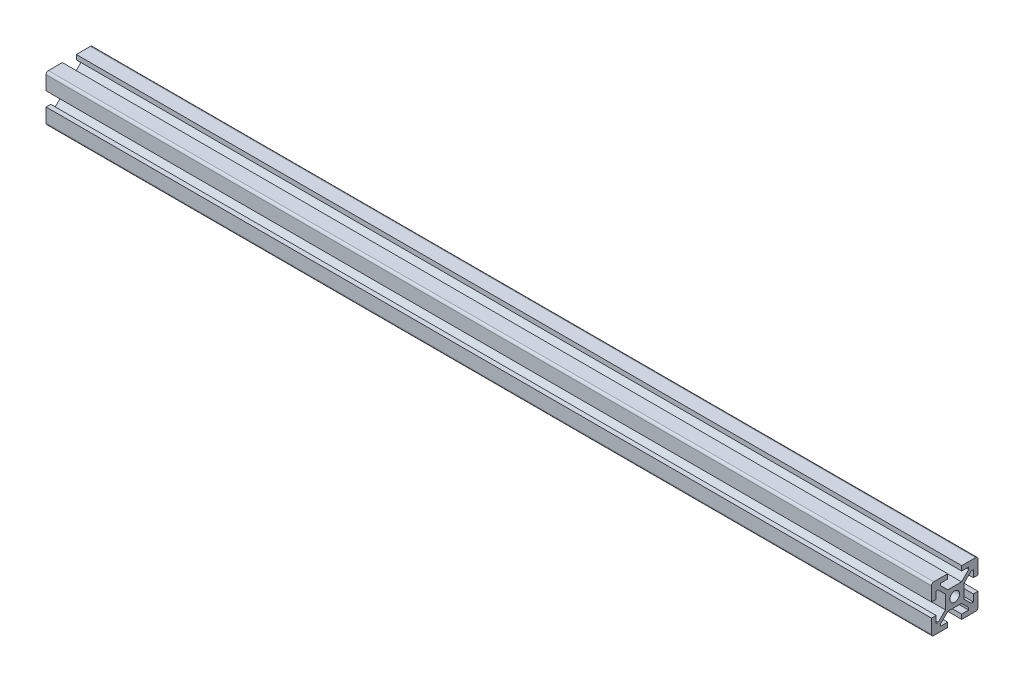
from build123d import *

# Parameters (mm, degrees)
SKETCH1_R           = 2.1
BOSS_EXTRUDE1_DEPTH = 380


with BuildPart() as part:
    # Sketch1 → Boss-Extrude1 (new body)
    with BuildSketch(Plane(origin=(0, 0, 0), x_dir=(0, 0, -1), z_dir=(1, 0, 0))):
        with BuildLine():
            Line((-10, 9), (-10, 3))
            Line((-10, 3), (-8, 3))
            Line((-8, 3), (-8, 6))
            Line((-8, 6), (-7.060660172, 6))
            Line((-7.060660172, 6), (-4, 2.939339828))
            Line((-4, 2.939339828), (-4, -2.939339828))
            Line((-4, -2.939339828), (-7.060660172, -6))
            Line((-7.060660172, -6), (-8, -6))
            Line((-8, -6), (-8, -3))
            Line((-8, -3), (-10, -3))
            Line((-10, -3), (-10, -9))
            ThreePointArc((-10, -9), (-9.707106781, -9.707106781), (-9, -10))
            Line((-9, -10), (-3, -10))
            Line((-3, -10), (-3, -8))
            Line((-3, -8), (-6, -8))
            Line((-6, -8), (-6, -7.060660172))
            Line((-6, -7.060660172), (-2.939339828, -4))
            Line((-2.939339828, -4), (2.939339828, -4))
            Line((2.939339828, -4), (6, -7.060660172))
            Line((6, -7.060660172), (6, -8))
            Line((6, -8), (3, -8))
            Line((3, -8), (3, -10))
            Line((3, -10), (9, -10))
            ThreePointArc((9, -10), (9.707106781, -9.707106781), (10, -9))
            Line((10, -9), (10, -3))
            Line((10, -3), (8, -3))
            Line((8, -3), (8, -6))
            Line((8, -6), (7.060660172, -6))
            Line((7.060660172, -6), (4, -2.939339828))
            Line((4, -2.939339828), (4, 2.939339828))
            Line((4, 2.939339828), (7.060660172, 6))
            Line((7.060660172, 6), (8, 6))
            Line((8, 6), (8, 3))
            Line((8, 3), (10, 3))
            Line((10, 3), (10, 9))
            ThreePointArc((10, 9), (9.707106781, 9.707106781), (9, 10))
            Line((9, 10), (3, 10))
            Line((3, 10), (3, 8))
            Line((3, 8), (6, 8))
            Line((6, 8), (6, 7.060660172))
            Line((6, 7.060660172), (2.939339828, 4))
            Line((2.939339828, 4), (-2.939339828, 4))
            Line((-2.939339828, 4), (-6, 7.060660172))
            Line((-6, 7.060660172), (-6, 8))
            Line((-6, 8), (-3, 8))
            Line((-3, 8), (-3, 10))
            Line((-3, 10), (-9, 10))
            ThreePointArc((-9, 10), (-9.707106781, 9.707106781), (-10, 9))
        make_face()
        Circle(SKETCH1_R, mode=Mode.SUBTRACT)
    extrude(amount=BOSS_EXTRUDE1_DEPTH)


solid = part.part
